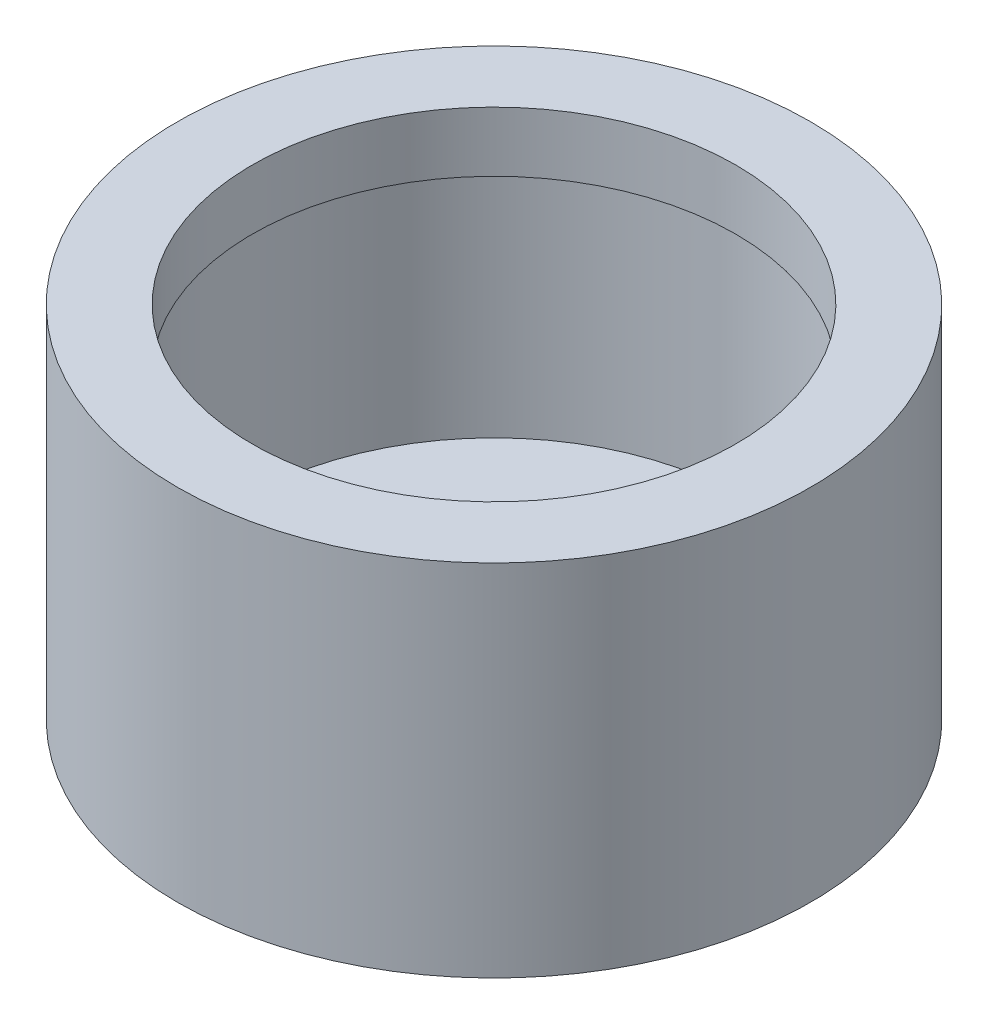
ISO-10303-21;
HEADER;
FILE_DESCRIPTION(('STEP AP214'),'2;1');
FILE_NAME('part.step','',(''),(''),'','','');
FILE_SCHEMA(('AUTOMOTIVE_DESIGN { 1 0 10303 214 1 1 1 1 }'));
ENDSEC;
DATA;
#1=APPLICATION_CONTEXT('core data for automotive mechanical design processes');
#2=APPLICATION_PROTOCOL_DEFINITION('international standard','automotive_design',2000,#1);
#3=PRODUCT_CONTEXT('',#1,'mechanical');
#4=PRODUCT('Part','Part','',(#3));
#5=PRODUCT_RELATED_PRODUCT_CATEGORY('part','',(#4));
#6=PRODUCT_DEFINITION_FORMATION('','',#4);
#7=PRODUCT_DEFINITION_CONTEXT('part definition',#1,'design');
#8=PRODUCT_DEFINITION('design','',#6,#7);
#9=PRODUCT_DEFINITION_SHAPE('','',#8);
#10=(LENGTH_UNIT() NAMED_UNIT(*) SI_UNIT(.MILLI.,.METRE.));
#11=(NAMED_UNIT(*) PLANE_ANGLE_UNIT() SI_UNIT($,.RADIAN.));
#12=(NAMED_UNIT(*) SI_UNIT($,.STERADIAN.) SOLID_ANGLE_UNIT());
#13=UNCERTAINTY_MEASURE_WITH_UNIT(LENGTH_MEASURE(1.E-05),#10,'distance_accuracy_value','');
#14=(GEOMETRIC_REPRESENTATION_CONTEXT(3) GLOBAL_UNCERTAINTY_ASSIGNED_CONTEXT((#13)) GLOBAL_UNIT_ASSIGNED_CONTEXT((#10,
#11,#12)) REPRESENTATION_CONTEXT('',''));
#15=CARTESIAN_POINT('',(0.,0.,0.));
#16=DIRECTION('',(0.,0.,1.));
#17=DIRECTION('',(1.,0.,0.));
#18=AXIS2_PLACEMENT_3D('',#15,#16,#17);
#19=CARTESIAN_POINT('',(18.796,0.,0.));
#20=DIRECTION('',(0.,-1.,0.));
#21=DIRECTION('',(0.,0.,-1.));
#22=AXIS2_PLACEMENT_3D('',#19,#20,#21);
#23=PLANE('',#22);
#24=CARTESIAN_POINT('',(-7.62,0.,14.732));
#25=DIRECTION('',(0.,-1.,0.));
#26=DIRECTION('',(0.,0.,-1.));
#27=AXIS2_PLACEMENT_3D('',#24,#25,#26);
#28=CIRCLE('',#27,1.13029999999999);
#29=CARTESIAN_POINT('',(-7.62,0.,13.6017));
#30=VERTEX_POINT('',#29);
#31=EDGE_CURVE('E60',#30,#30,#28,.T.);
#32=ORIENTED_EDGE('',*,*,#31,.F.);
#33=EDGE_LOOP('',(#32));
#34=FACE_BOUND('',#33,.T.);
#35=CARTESIAN_POINT('',(7.62,0.,14.732));
#36=DIRECTION('',(0.,-1.,0.));
#37=DIRECTION('',(0.,0.,-1.));
#38=AXIS2_PLACEMENT_3D('',#35,#36,#37);
#39=CIRCLE('',#38,1.13029999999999);
#40=CARTESIAN_POINT('',(7.62,0.,13.6017));
#41=VERTEX_POINT('',#40);
#42=EDGE_CURVE('E59',#41,#41,#39,.T.);
#43=ORIENTED_EDGE('',*,*,#42,.F.);
#44=EDGE_LOOP('',(#43));
#45=FACE_BOUND('',#44,.T.);
#46=CARTESIAN_POINT('',(0.,0.,0.));
#47=DIRECTION('',(0.,-1.,0.));
#48=DIRECTION('',(0.,0.,-1.));
#49=AXIS2_PLACEMENT_3D('',#46,#47,#48);
#50=CIRCLE('',#49,18.796);
#51=CARTESIAN_POINT('',(0.,0.,-18.796));
#52=VERTEX_POINT('',#51);
#53=EDGE_CURVE('E70',#52,#52,#50,.T.);
#54=ORIENTED_EDGE('',*,*,#53,.T.);
#55=EDGE_LOOP('',(#54));
#56=FACE_BOUND('',#55,.T.);
#57=ADVANCED_FACE('F36',(#34,#45,#56),#23,.T.);
#58=CARTESIAN_POINT('',(0.,4.064,0.));
#59=DIRECTION('',(0.,1.,0.));
#60=DIRECTION('',(0.,0.,1.));
#61=AXIS2_PLACEMENT_3D('',#58,#59,#60);
#62=PLANE('',#61);
#63=CARTESIAN_POINT('',(0.,4.064,0.));
#64=DIRECTION('',(0.,-1.,0.));
#65=DIRECTION('',(0.,0.,-1.));
#66=AXIS2_PLACEMENT_3D('',#63,#64,#65);
#67=CIRCLE('',#66,14.732);
#68=CARTESIAN_POINT('',(0.,4.064,-14.732));
#69=VERTEX_POINT('',#68);
#70=EDGE_CURVE('E11',#69,#69,#67,.T.);
#71=ORIENTED_EDGE('',*,*,#70,.F.);
#72=EDGE_LOOP('',(#71));
#73=FACE_BOUND('',#72,.T.);
#74=ADVANCED_FACE('F89',(#73),#62,.T.);
#75=CARTESIAN_POINT('',(0.,4.064,0.));
#76=DIRECTION('',(0.,-1.,0.));
#77=DIRECTION('',(0.,0.,-1.));
#78=AXIS2_PLACEMENT_3D('',#75,#76,#77);
#79=CYLINDRICAL_SURFACE('',#78,14.732);
#80=ORIENTED_EDGE('',*,*,#70,.T.);
#81=EDGE_LOOP('',(#80));
#82=FACE_BOUND('',#81,.T.);
#83=CARTESIAN_POINT('',(0.,17.78,0.));
#84=DIRECTION('',(0.,-1.,0.));
#85=DIRECTION('',(0.,0.,-1.));
#86=AXIS2_PLACEMENT_3D('',#83,#84,#85);
#87=CIRCLE('',#86,14.732);
#88=CARTESIAN_POINT('',(0.,17.78,-14.732));
#89=VERTEX_POINT('',#88);
#90=EDGE_CURVE('E43',#89,#89,#87,.T.);
#91=ORIENTED_EDGE('',*,*,#90,.F.);
#92=EDGE_LOOP('',(#91));
#93=FACE_BOUND('',#92,.T.);
#94=ADVANCED_FACE('F87',(#82,#93),#79,.F.);
#95=CARTESIAN_POINT('',(14.732,17.78,0.));
#96=DIRECTION('',(0.,-1.,0.));
#97=DIRECTION('',(0.,0.,-1.));
#98=AXIS2_PLACEMENT_3D('',#95,#96,#97);
#99=PLANE('',#98);
#100=ORIENTED_EDGE('',*,*,#90,.T.);
#101=EDGE_LOOP('',(#100));
#102=FACE_BOUND('',#101,.T.);
#103=CARTESIAN_POINT('',(0.,17.78,0.));
#104=DIRECTION('',(0.,-1.,0.));
#105=DIRECTION('',(0.,0.,-1.));
#106=AXIS2_PLACEMENT_3D('',#103,#104,#105);
#107=CIRCLE('',#106,14.351);
#108=CARTESIAN_POINT('',(0.,17.78,-14.351));
#109=VERTEX_POINT('',#108);
#110=EDGE_CURVE('E79',#109,#109,#107,.T.);
#111=ORIENTED_EDGE('',*,*,#110,.F.);
#112=EDGE_LOOP('',(#111));
#113=FACE_BOUND('',#112,.T.);
#114=ADVANCED_FACE('F84',(#102,#113),#99,.T.);
#115=CARTESIAN_POINT('',(0.,4.064,0.));
#116=DIRECTION('',(0.,-1.,0.));
#117=DIRECTION('',(0.,0.,-1.));
#118=AXIS2_PLACEMENT_3D('',#115,#116,#117);
#119=CYLINDRICAL_SURFACE('',#118,14.351);
#120=ORIENTED_EDGE('',*,*,#110,.T.);
#121=EDGE_LOOP('',(#120));
#122=FACE_BOUND('',#121,.T.);
#123=CARTESIAN_POINT('',(0.,21.336,0.));
#124=DIRECTION('',(0.,-1.,0.));
#125=DIRECTION('',(0.,0.,-1.));
#126=AXIS2_PLACEMENT_3D('',#123,#124,#125);
#127=CIRCLE('',#126,14.351);
#128=CARTESIAN_POINT('',(0.,21.336,-14.351));
#129=VERTEX_POINT('',#128);
#130=EDGE_CURVE('E76',#129,#129,#127,.T.);
#131=ORIENTED_EDGE('',*,*,#130,.F.);
#132=EDGE_LOOP('',(#131));
#133=FACE_BOUND('',#132,.T.);
#134=ADVANCED_FACE('F96',(#122,#133),#119,.F.);
#135=CARTESIAN_POINT('',(14.351,21.336,0.));
#136=DIRECTION('',(0.,1.,0.));
#137=DIRECTION('',(0.,0.,1.));
#138=AXIS2_PLACEMENT_3D('',#135,#136,#137);
#139=PLANE('',#138);
#140=ORIENTED_EDGE('',*,*,#130,.T.);
#141=EDGE_LOOP('',(#140));
#142=FACE_BOUND('',#141,.T.);
#143=CARTESIAN_POINT('',(0.,21.336,0.));
#144=DIRECTION('',(0.,-1.,0.));
#145=DIRECTION('',(0.,0.,-1.));
#146=AXIS2_PLACEMENT_3D('',#143,#144,#145);
#147=CIRCLE('',#146,18.796);
#148=CARTESIAN_POINT('',(0.,21.336,-18.796));
#149=VERTEX_POINT('',#148);
#150=EDGE_CURVE('E73',#149,#149,#147,.T.);
#151=ORIENTED_EDGE('',*,*,#150,.F.);
#152=EDGE_LOOP('',(#151));
#153=FACE_BOUND('',#152,.T.);
#154=ADVANCED_FACE('F112',(#142,#153),#139,.T.);
#155=CARTESIAN_POINT('',(0.,4.064,0.));
#156=DIRECTION('',(0.,-1.,0.));
#157=DIRECTION('',(0.,0.,-1.));
#158=AXIS2_PLACEMENT_3D('',#155,#156,#157);
#159=CYLINDRICAL_SURFACE('',#158,18.796);
#160=ORIENTED_EDGE('',*,*,#150,.T.);
#161=EDGE_LOOP('',(#160));
#162=FACE_BOUND('',#161,.T.);
#163=ORIENTED_EDGE('',*,*,#53,.F.);
#164=EDGE_LOOP('',(#163));
#165=FACE_BOUND('',#164,.T.);
#166=ADVANCED_FACE('F109',(#162,#165),#159,.T.);
#167=CARTESIAN_POINT('',(7.62,6.35,14.732));
#168=DIRECTION('',(0.,-1.,0.));
#169=DIRECTION('',(0.,0.,-1.));
#170=AXIS2_PLACEMENT_3D('',#167,#168,#169);
#171=CONICAL_SURFACE('',#170,1.1303,1.02974425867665);
#172=CARTESIAN_POINT('',(7.62,7.02915275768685,14.732));
#173=VERTEX_POINT('',#172);
#174=VERTEX_LOOP('',#173);
#175=FACE_BOUND('',#174,.T.);
#176=CARTESIAN_POINT('',(7.62,6.35,14.732));
#177=DIRECTION('',(0.,-1.,0.));
#178=DIRECTION('',(0.,0.,-1.));
#179=AXIS2_PLACEMENT_3D('',#176,#177,#178);
#180=CIRCLE('',#179,1.1303);
#181=CARTESIAN_POINT('',(7.62,6.35,13.6017));
#182=VERTEX_POINT('',#181);
#183=EDGE_CURVE('E63',#182,#182,#180,.T.);
#184=ORIENTED_EDGE('',*,*,#183,.T.);
#185=EDGE_LOOP('',(#184));
#186=FACE_BOUND('',#185,.T.);
#187=ADVANCED_FACE('F111',(#175,#186),#171,.F.);
#188=CARTESIAN_POINT('',(7.62,0.,14.732));
#189=DIRECTION('',(0.,-1.,0.));
#190=DIRECTION('',(0.,0.,-1.));
#191=AXIS2_PLACEMENT_3D('',#188,#189,#190);
#192=CYLINDRICAL_SURFACE('',#191,1.13029999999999);
#193=ORIENTED_EDGE('',*,*,#183,.F.);
#194=EDGE_LOOP('',(#193));
#195=FACE_BOUND('',#194,.T.);
#196=ORIENTED_EDGE('',*,*,#42,.T.);
#197=EDGE_LOOP('',(#196));
#198=FACE_BOUND('',#197,.T.);
#199=ADVANCED_FACE('F53',(#195,#198),#192,.F.);
#200=CARTESIAN_POINT('',(-7.62,6.35,14.732));
#201=DIRECTION('',(0.,-1.,0.));
#202=DIRECTION('',(0.,0.,-1.));
#203=AXIS2_PLACEMENT_3D('',#200,#201,#202);
#204=CONICAL_SURFACE('',#203,1.1303,1.02974425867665);
#205=CARTESIAN_POINT('',(-7.62,7.02915275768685,14.732));
#206=VERTEX_POINT('',#205);
#207=VERTEX_LOOP('',#206);
#208=FACE_BOUND('',#207,.T.);
#209=CARTESIAN_POINT('',(-7.62,6.35,14.732));
#210=DIRECTION('',(0.,-1.,0.));
#211=DIRECTION('',(0.,0.,-1.));
#212=AXIS2_PLACEMENT_3D('',#209,#210,#211);
#213=CIRCLE('',#212,1.1303);
#214=CARTESIAN_POINT('',(-7.62,6.35,13.6017));
#215=VERTEX_POINT('',#214);
#216=EDGE_CURVE('E57',#215,#215,#213,.T.);
#217=ORIENTED_EDGE('',*,*,#216,.T.);
#218=EDGE_LOOP('',(#217));
#219=FACE_BOUND('',#218,.T.);
#220=ADVANCED_FACE('F49',(#208,#219),#204,.F.);
#221=CARTESIAN_POINT('',(-7.62,0.,14.732));
#222=DIRECTION('',(0.,-1.,0.));
#223=DIRECTION('',(0.,0.,-1.));
#224=AXIS2_PLACEMENT_3D('',#221,#222,#223);
#225=CYLINDRICAL_SURFACE('',#224,1.13029999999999);
#226=ORIENTED_EDGE('',*,*,#216,.F.);
#227=EDGE_LOOP('',(#226));
#228=FACE_BOUND('',#227,.T.);
#229=ORIENTED_EDGE('',*,*,#31,.T.);
#230=EDGE_LOOP('',(#229));
#231=FACE_BOUND('',#230,.T.);
#232=ADVANCED_FACE('F52',(#228,#231),#225,.F.);
#233=CLOSED_SHELL('',(#57,#74,#94,#114,#134,#154,#166,#187,#199,#220,#232));
#234=MANIFOLD_SOLID_BREP('B2',#233);
#235=ADVANCED_BREP_SHAPE_REPRESENTATION('',(#18,#234),#14);
#236=SHAPE_DEFINITION_REPRESENTATION(#9,#235);
ENDSEC;
END-ISO-10303-21;
